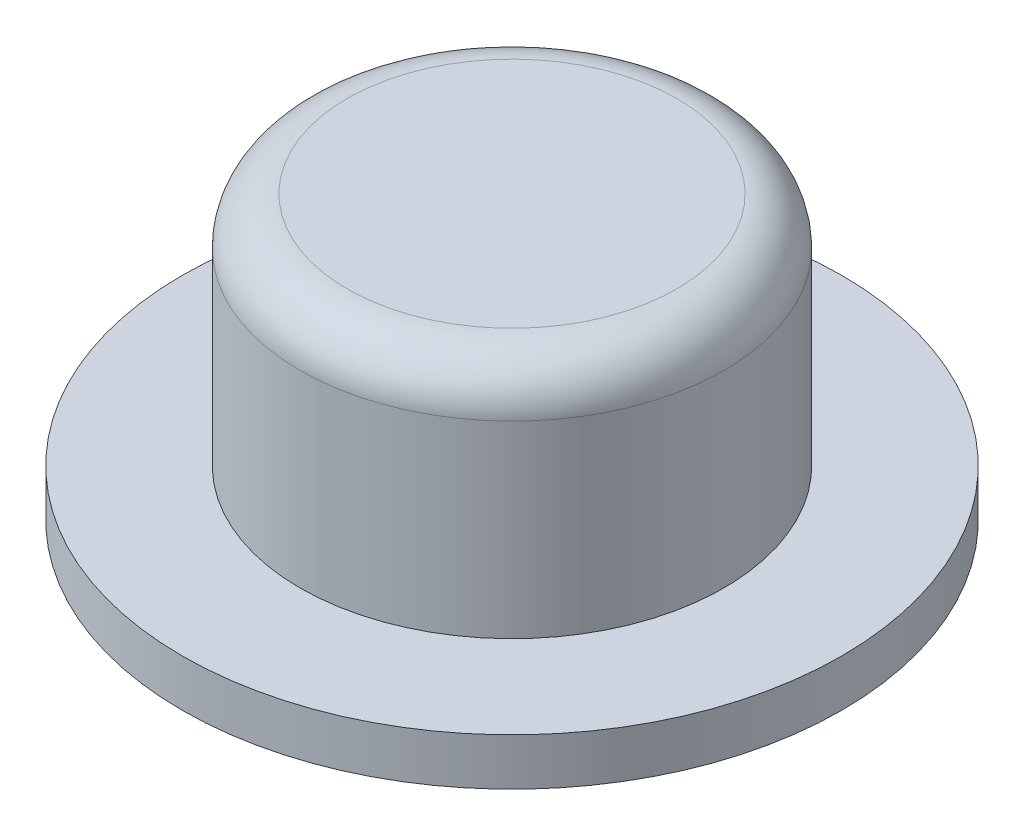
from build123d import *


with BuildPart() as part:
    # Sketch1 → Center Button (revolve)
    with BuildSketch(Plane.XY, mode=Mode.PRIVATE) as center_button_sk:
        with BuildLine():
            Line((0, 0), (0, 6))
            Line((0, 6), (-3.5, 6))
            ThreePointArc((-3.5, 6), (-4.207106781, 5.707106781), (-4.5, 5))
            Line((-4.5, 5), (-4.5, 1))
            Line((-4.5, 1), (-7, 1))
            Line((-7, 1), (-7, 0))
            Line((-7, 0), (0, 0))
        make_face()
    revolve(center_button_sk.sketch.rotate(Axis((0, 0, 0), (0, 1, 0)), 270), axis=Axis((0, 0, 0), (0, 1, 0)))


solid = part.part
